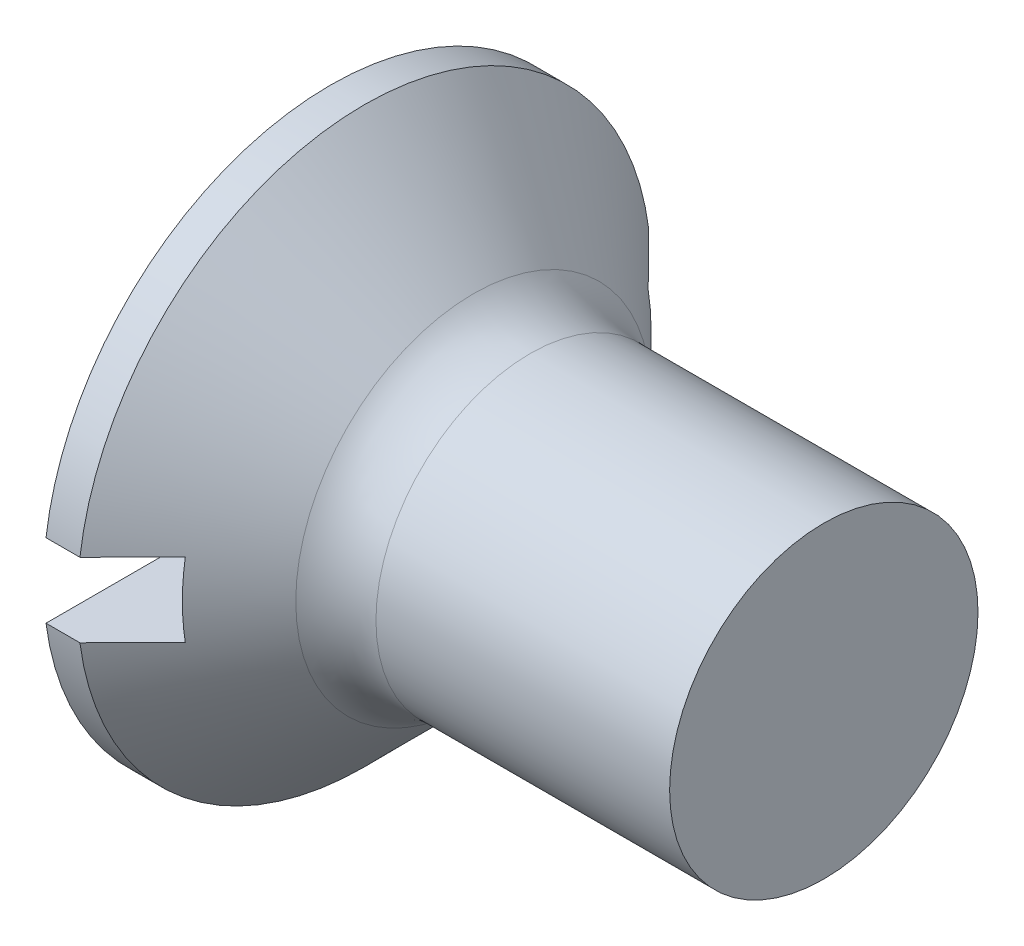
ISO-10303-21;
HEADER;
FILE_DESCRIPTION(('STEP AP214'),'2;1');
FILE_NAME('part.step','',(''),(''),'','','');
FILE_SCHEMA(('AUTOMOTIVE_DESIGN { 1 0 10303 214 1 1 1 1 }'));
ENDSEC;
DATA;
#1=APPLICATION_CONTEXT('core data for automotive mechanical design processes');
#2=APPLICATION_PROTOCOL_DEFINITION('international standard','automotive_design',2000,#1);
#3=PRODUCT_CONTEXT('',#1,'mechanical');
#4=PRODUCT('Part','Part','',(#3));
#5=PRODUCT_RELATED_PRODUCT_CATEGORY('part','',(#4));
#6=PRODUCT_DEFINITION_FORMATION('','',#4);
#7=PRODUCT_DEFINITION_CONTEXT('part definition',#1,'design');
#8=PRODUCT_DEFINITION('design','',#6,#7);
#9=PRODUCT_DEFINITION_SHAPE('','',#8);
#10=(LENGTH_UNIT() NAMED_UNIT(*) SI_UNIT(.MILLI.,.METRE.));
#11=(NAMED_UNIT(*) PLANE_ANGLE_UNIT() SI_UNIT($,.RADIAN.));
#12=(NAMED_UNIT(*) SI_UNIT($,.STERADIAN.) SOLID_ANGLE_UNIT());
#13=UNCERTAINTY_MEASURE_WITH_UNIT(LENGTH_MEASURE(1.E-05),#10,'distance_accuracy_value','');
#14=(GEOMETRIC_REPRESENTATION_CONTEXT(3) GLOBAL_UNCERTAINTY_ASSIGNED_CONTEXT((#13)) GLOBAL_UNIT_ASSIGNED_CONTEXT((#10,
#11,#12)) REPRESENTATION_CONTEXT('',''));
#15=CARTESIAN_POINT('',(0.,0.,0.));
#16=DIRECTION('',(0.,0.,1.));
#17=DIRECTION('',(1.,0.,0.));
#18=AXIS2_PLACEMENT_3D('',#15,#16,#17);
#19=CARTESIAN_POINT('',(0.,0.,0.));
#20=DIRECTION('',(-1.,0.,0.));
#21=DIRECTION('',(0.,0.,1.));
#22=AXIS2_PLACEMENT_3D('',#19,#20,#21);
#23=PLANE('',#22);
#24=DIRECTION('',(0.,0.,-1.));
#25=VECTOR('',#24,1.);
#26=CARTESIAN_POINT('',(0.,0.600000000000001,4.65));
#27=LINE('',#26,#25);
#28=CARTESIAN_POINT('',(0.,0.600000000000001,4.61112784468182));
#29=VERTEX_POINT('',#28);
#30=CARTESIAN_POINT('',(0.,0.599999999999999,-4.61112784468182));
#31=VERTEX_POINT('',#30);
#32=EDGE_CURVE('E169',#29,#31,#27,.T.);
#33=ORIENTED_EDGE('',*,*,#32,.F.);
#34=CARTESIAN_POINT('',(0.,0.,0.));
#35=DIRECTION('',(-1.,0.,0.));
#36=DIRECTION('',(0.,0.,1.));
#37=AXIS2_PLACEMENT_3D('',#34,#35,#36);
#38=CIRCLE('',#37,4.65);
#39=EDGE_CURVE('E113',#29,#31,#38,.T.);
#40=ORIENTED_EDGE('',*,*,#39,.T.);
#41=EDGE_LOOP('',(#33,#40));
#42=FACE_BOUND('',#41,.T.);
#43=ADVANCED_FACE('F32',(#42),#23,.T.);
#44=CARTESIAN_POINT('',(-6.34999999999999,0.,0.));
#45=DIRECTION('',(-1.,0.,0.));
#46=DIRECTION('',(0.,0.,1.));
#47=AXIS2_PLACEMENT_3D('',#44,#45,#46);
#48=CYLINDRICAL_SURFACE('',#47,4.65);
#49=DIRECTION('',(-1.,0.,0.));
#50=VECTOR('',#49,1.);
#51=CARTESIAN_POINT('',(-6.34999999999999,0.599999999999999,-4.61112784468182));
#52=LINE('',#51,#50);
#53=CARTESIAN_POINT('',(0.550000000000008,0.599999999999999,-4.61112784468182));
#54=VERTEX_POINT('',#53);
#55=EDGE_CURVE('E60',#31,#54,#52,.F.);
#56=ORIENTED_EDGE('',*,*,#55,.F.);
#57=ORIENTED_EDGE('',*,*,#39,.F.);
#58=DIRECTION('',(-1.,0.,0.));
#59=VECTOR('',#58,1.);
#60=CARTESIAN_POINT('',(-6.34999999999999,0.600000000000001,4.61112784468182));
#61=LINE('',#60,#59);
#62=CARTESIAN_POINT('',(0.550000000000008,0.600000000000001,4.61112784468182));
#63=VERTEX_POINT('',#62);
#64=EDGE_CURVE('E175',#63,#29,#61,.T.);
#65=ORIENTED_EDGE('',*,*,#64,.F.);
#66=CARTESIAN_POINT('',(0.550000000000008,0.,0.));
#67=DIRECTION('',(-1.,0.,0.));
#68=DIRECTION('',(0.,0.,1.));
#69=AXIS2_PLACEMENT_3D('',#66,#67,#68);
#70=CIRCLE('',#69,4.65);
#71=EDGE_CURVE('E107',#63,#54,#70,.T.);
#72=ORIENTED_EDGE('',*,*,#71,.T.);
#73=EDGE_LOOP('',(#56,#57,#65,#72));
#74=FACE_BOUND('',#73,.T.);
#75=ADVANCED_FACE('F153',(#74),#48,.T.);
#76=DIRECTION('',(0.,0.,1.));
#77=VECTOR('',#76,1.);
#78=CARTESIAN_POINT('',(0.,-0.600000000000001,-4.65));
#79=LINE('',#78,#77);
#80=CARTESIAN_POINT('',(0.,-0.600000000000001,-4.61112784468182));
#81=VERTEX_POINT('',#80);
#82=CARTESIAN_POINT('',(0.,-0.600000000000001,4.61112784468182));
#83=VERTEX_POINT('',#82);
#84=EDGE_CURVE('E101',#81,#83,#79,.T.);
#85=ORIENTED_EDGE('',*,*,#84,.F.);
#86=EDGE_CURVE('E109',#81,#83,#38,.T.);
#87=ORIENTED_EDGE('',*,*,#86,.T.);
#88=EDGE_LOOP('',(#85,#87));
#89=FACE_BOUND('',#88,.T.);
#90=ADVANCED_FACE('F155',(#89),#23,.T.);
#91=DIRECTION('',(-1.,0.,0.));
#92=VECTOR('',#91,1.);
#93=CARTESIAN_POINT('',(-6.34999999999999,-0.600000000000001,4.61112784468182));
#94=LINE('',#93,#92);
#95=CARTESIAN_POINT('',(0.550000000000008,-0.600000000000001,4.61112784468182));
#96=VERTEX_POINT('',#95);
#97=EDGE_CURVE('E174',#83,#96,#94,.F.);
#98=ORIENTED_EDGE('',*,*,#97,.F.);
#99=ORIENTED_EDGE('',*,*,#86,.F.);
#100=DIRECTION('',(-1.,0.,0.));
#101=VECTOR('',#100,1.);
#102=CARTESIAN_POINT('',(-6.34999999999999,-0.600000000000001,-4.61112784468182));
#103=LINE('',#102,#101);
#104=CARTESIAN_POINT('',(0.550000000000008,-0.600000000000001,-4.61112784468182));
#105=VERTEX_POINT('',#104);
#106=EDGE_CURVE('E172',#105,#81,#103,.T.);
#107=ORIENTED_EDGE('',*,*,#106,.F.);
#108=EDGE_CURVE('E110',#105,#96,#70,.T.);
#109=ORIENTED_EDGE('',*,*,#108,.T.);
#110=EDGE_LOOP('',(#98,#99,#107,#109));
#111=FACE_BOUND('',#110,.T.);
#112=ADVANCED_FACE('F150',(#111),#48,.T.);
#113=CARTESIAN_POINT('',(0.550000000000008,0.,0.));
#114=DIRECTION('',(-1.,0.,0.));
#115=DIRECTION('',(0.,0.,1.));
#116=AXIS2_PLACEMENT_3D('',#113,#114,#115);
#117=CONICAL_SURFACE('',#116,4.65,0.78539816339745);
#118=CARTESIAN_POINT('',(-5.05345798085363,0.599999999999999,-10.2358878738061));
#119=CARTESIAN_POINT('',(-4.7063338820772,0.599999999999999,-9.88816346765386));
#120=CARTESIAN_POINT('',(-4.35923588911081,0.599999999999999,-9.54041298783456));
#121=CARTESIAN_POINT('',(-3.66512028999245,0.599999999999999,-8.84482295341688));
#122=CARTESIAN_POINT('',(-3.31810268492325,0.599999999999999,-8.49698339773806));
#123=CARTESIAN_POINT('',(-2.6240861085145,0.599999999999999,-7.80108810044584));
#124=CARTESIAN_POINT('',(-2.27708717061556,0.599999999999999,-7.45303232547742));
#125=CARTESIAN_POINT('',(-1.58327190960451,0.599999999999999,-6.75674744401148));
#126=CARTESIAN_POINT('',(-1.23645558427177,0.599999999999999,-6.40851833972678));
#127=CARTESIAN_POINT('',(-0.530234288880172,0.599999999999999,-5.69884909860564));
#128=CARTESIAN_POINT('',(-0.170839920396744,0.599999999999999,-5.3373984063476));
#129=CARTESIAN_POINT('',(0.367846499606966,0.599999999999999,-4.79480605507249));
#130=CARTESIAN_POINT('',(0.547344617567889,0.599999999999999,-4.61386901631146));
#131=CARTESIAN_POINT('',(0.906142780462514,0.599999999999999,-4.251800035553));
#132=CARTESIAN_POINT('',(1.08544282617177,0.6,-4.07066809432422));
#133=CARTESIAN_POINT('',(1.44372217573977,0.6,-3.70815209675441));
#134=CARTESIAN_POINT('',(1.62270153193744,0.6,-3.52676809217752));
#135=CARTESIAN_POINT('',(1.98021132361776,0.6,-3.16355280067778));
#136=CARTESIAN_POINT('',(2.1587417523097,0.6,-2.98172150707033));
#137=CARTESIAN_POINT('',(2.51504600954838,0.6,-2.61734150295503));
#138=CARTESIAN_POINT('',(2.69281988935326,0.6,-2.43479284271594));
#139=CARTESIAN_POINT('',(2.95840184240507,0.6,-2.15993102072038));
#140=CARTESIAN_POINT('',(3.0467482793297,0.6,-2.06813839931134));
#141=CARTESIAN_POINT('',(3.22290791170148,0.6,-1.8840432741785));
#142=CARTESIAN_POINT('',(3.31072111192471,0.6,-1.79174077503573));
#143=CARTESIAN_POINT('',(3.44507973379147,0.6,-1.64924720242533));
#144=CARTESIAN_POINT('',(3.49191887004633,0.6,-1.59933324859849));
#145=CARTESIAN_POINT('',(3.58528403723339,0.6,-1.49921165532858));
#146=CARTESIAN_POINT('',(3.63181006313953,0.6,-1.44900401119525));
#147=CARTESIAN_POINT('',(3.72427703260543,0.6,-1.348388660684));
#148=CARTESIAN_POINT('',(3.77021949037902,0.6,-1.29798234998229));
#149=CARTESIAN_POINT('',(3.86152904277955,0.6,-1.19665513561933));
#150=CARTESIAN_POINT('',(3.90689615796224,0.6,-1.1457342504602));
#151=CARTESIAN_POINT('',(4.01209252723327,0.6,-1.02578570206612));
#152=CARTESIAN_POINT('',(4.07160553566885,0.6,-0.956477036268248));
#153=CARTESIAN_POINT('',(4.15917887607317,0.6,-0.850702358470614));
#154=CARTESIAN_POINT('',(4.18818199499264,0.6,-0.815019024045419));
#155=CARTESIAN_POINT('',(4.24528795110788,0.6,-0.742941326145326));
#156=CARTESIAN_POINT('',(4.27339088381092,0.6,-0.706547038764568));
#157=CARTESIAN_POINT('',(4.32869682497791,0.6,-0.632291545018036));
#158=CARTESIAN_POINT('',(4.35588213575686,0.6,-0.594417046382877));
#159=CARTESIAN_POINT('',(4.40832254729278,0.6,-0.517260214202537));
#160=CARTESIAN_POINT('',(4.43357498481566,0.6,-0.477976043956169));
#161=CARTESIAN_POINT('',(4.48075024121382,0.6,-0.397940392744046));
#162=CARTESIAN_POINT('',(4.50270366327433,0.6,-0.357207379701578));
#163=CARTESIAN_POINT('',(4.54164745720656,0.6,-0.273493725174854));
#164=CARTESIAN_POINT('',(4.55865364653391,0.6,-0.230520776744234));
#165=CARTESIAN_POINT('',(4.58372379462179,0.6,-0.145820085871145));
#166=CARTESIAN_POINT('',(4.59242377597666,0.6,-0.104295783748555));
#167=CARTESIAN_POINT('',(4.59893532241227,0.6,-0.0414391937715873));
#168=CARTESIAN_POINT('',(4.60002000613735,0.6,-0.0204304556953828));
#169=CARTESIAN_POINT('',(4.59997943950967,0.6,0.0215839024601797));
#170=CARTESIAN_POINT('',(4.59885411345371,0.6,0.0425895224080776));
#171=CARTESIAN_POINT('',(4.59227145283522,0.6,0.10501520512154));
#172=CARTESIAN_POINT('',(4.58363501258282,0.6,0.1461245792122));
#173=CARTESIAN_POINT('',(4.565808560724,0.6,0.206345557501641));
#174=CARTESIAN_POINT('',(4.55901965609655,0.6,0.226250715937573));
#175=CARTESIAN_POINT('',(4.54410905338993,0.6,0.265557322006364));
#176=CARTESIAN_POINT('',(4.53598757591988,0.6,0.284958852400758));
#177=CARTESIAN_POINT('',(4.51162458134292,0.6,0.33886087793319));
#178=CARTESIAN_POINT('',(4.49415337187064,0.6,0.372800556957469));
#179=CARTESIAN_POINT('',(4.45684225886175,0.6,0.439365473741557));
#180=CARTESIAN_POINT('',(4.436999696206,0.6,0.471989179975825));
#181=CARTESIAN_POINT('',(4.39563171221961,0.6,0.53629862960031));
#182=CARTESIAN_POINT('',(4.37410080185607,0.6,0.567980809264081));
#183=CARTESIAN_POINT('',(4.32989042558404,0.6,0.630537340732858));
#184=CARTESIAN_POINT('',(4.30721068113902,0.6,0.661411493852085));
#185=CARTESIAN_POINT('',(4.23751211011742,0.6,0.753681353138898));
#186=CARTESIAN_POINT('',(4.18923822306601,0.6,0.814124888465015));
#187=CARTESIAN_POINT('',(4.0909576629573,0.6,0.933321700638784));
#188=CARTESIAN_POINT('',(4.04095530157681,0.6,0.992078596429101));
#189=CARTESIAN_POINT('',(3.94086297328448,0.6,1.10735067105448));
#190=CARTESIAN_POINT('',(3.89079728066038,0.6,1.16388697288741));
#191=CARTESIAN_POINT('',(3.78992367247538,0.6,1.27629304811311));
#192=CARTESIAN_POINT('',(3.73911573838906,0.6,1.33216280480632));
#193=CARTESIAN_POINT('',(3.58591315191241,0.6,1.49908452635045));
#194=CARTESIAN_POINT('',(3.4827535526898,0.6,1.609433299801));
#195=CARTESIAN_POINT('',(3.27521830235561,0.6,1.82922471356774));
#196=CARTESIAN_POINT('',(3.17084134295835,0.6,1.93866611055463));
#197=CARTESIAN_POINT('',(2.96141984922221,0.6,2.15689179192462));
#198=CARTESIAN_POINT('',(2.85637536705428,0.6,2.26567612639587));
#199=CARTESIAN_POINT('',(2.64692360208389,0.6,2.481710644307));
#200=CARTESIAN_POINT('',(2.5425207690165,0.6,2.58896514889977));
#201=CARTESIAN_POINT('',(2.33341496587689,0.6,2.80318525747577));
#202=CARTESIAN_POINT('',(2.22871198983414,0.6,2.91015085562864));
#203=CARTESIAN_POINT('',(1.91438863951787,0.6,3.23063427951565));
#204=CARTESIAN_POINT('',(1.70445280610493,0.6,3.44384256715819));
#205=CARTESIAN_POINT('',(1.22510768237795,0.6,3.9295930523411));
#206=CARTESIAN_POINT('',(0.955548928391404,0.600000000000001,4.20198758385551));
#207=CARTESIAN_POINT('',(0.416004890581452,0.600000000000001,4.74635530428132));
#208=CARTESIAN_POINT('',(0.146019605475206,0.600000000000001,5.01832849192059));
#209=CARTESIAN_POINT('',(-0.664426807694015,0.600000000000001,5.83398149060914));
#210=CARTESIAN_POINT('',(-1.2052682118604,0.600000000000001,6.37728333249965));
#211=CARTESIAN_POINT('',(-2.297244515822,0.600000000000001,7.47334328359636));
#212=CARTESIAN_POINT('',(-2.84838746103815,0.600000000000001,8.02609337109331));
#213=CARTESIAN_POINT('',(-3.95082527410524,0.600000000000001,9.1312059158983));
#214=CARTESIAN_POINT('',(-4.5021200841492,0.600000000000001,9.683568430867));
#215=CARTESIAN_POINT('',(-5.05345798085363,0.600000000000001,10.2358878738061));
#216=B_SPLINE_CURVE_WITH_KNOTS('',3,(#118,#119,#120,#121,#122,#123,#124,#125,#126,#127,#128,
#129,#130,#131,#132,#133,#134,#135,#136,#137,#138,#139,#140,#141,#142,#143,#144,#145,#146,#147,
#148,#149,#150,#151,#152,#153,#154,#155,#156,#157,#158,#159,#160,#161,#162,#163,#164,#165,#166,
#167,#168,#169,#170,#171,#172,#173,#174,#175,#176,#177,#178,#179,#180,#181,#182,#183,#184,#185,
#186,#187,#188,#189,#190,#191,#192,#193,#194,#195,#196,#197,#198,#199,#200,#201,#202,#203,#204,
#205,#206,#207,#208,#209,#210,#211,#212,#213,#214,#215),.UNSPECIFIED.,.F.,.F.,(4,2,2,2,2,2,2,2,
2,2,2,2,2,2,2,2,2,2,2,2,2,2,2,2,2,2,2,2,2,2,2,2,2,2,2,2,2,2,2,2,2,2,2,2,2,2,2,2,4),(0.,
1.47399683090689,2.94801247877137,4.4224478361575,5.89686482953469,7.42601395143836,
8.19061836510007,8.95521977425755,9.71968231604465,10.4841563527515,11.2485777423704,
11.630779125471,12.0129770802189,12.2183239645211,12.4236741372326,12.6282760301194,
12.8328705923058,13.1068888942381,13.2448295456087,13.3827555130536,13.522578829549,
13.6625914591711,13.8012122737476,13.9393848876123,14.0658401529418,14.1288404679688,
14.1918429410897,14.3170190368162,14.3800826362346,14.4431358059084,14.557498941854,
14.6719915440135,14.7868731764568,14.9017827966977,15.1337679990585,15.365211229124,
15.5917537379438,15.8183019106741,16.2714608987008,16.7251625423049,17.1788291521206,
17.6278622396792,18.076904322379,18.9745538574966,20.1242253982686,21.2739004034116,
23.5737206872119,25.9154338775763,28.2566456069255),.UNSPECIFIED.);
#217=CARTESIAN_POINT('',(1.4,0.6,3.75233260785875));
#218=VERTEX_POINT('',#217);
#219=EDGE_CURVE('E11',#218,#63,#216,.T.);
#220=ORIENTED_EDGE('',*,*,#219,.F.);
#221=CARTESIAN_POINT('',(1.4,0.,0.));
#222=DIRECTION('',(1.,0.,0.));
#223=DIRECTION('',(0.,0.,-1.));
#224=AXIS2_PLACEMENT_3D('',#221,#222,#223);
#225=CIRCLE('',#224,3.80000000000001);
#226=CARTESIAN_POINT('',(1.4,-0.600000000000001,3.75233260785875));
#227=VERTEX_POINT('',#226);
#228=EDGE_CURVE('E89',#227,#218,#225,.F.);
#229=ORIENTED_EDGE('',*,*,#228,.F.);
#230=CARTESIAN_POINT('',(-5.05345798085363,-0.600000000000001,10.2358878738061));
#231=CARTESIAN_POINT('',(-4.7063338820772,-0.600000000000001,9.88816346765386));
#232=CARTESIAN_POINT('',(-4.35923588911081,-0.600000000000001,9.54041298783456));
#233=CARTESIAN_POINT('',(-3.66512028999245,-0.600000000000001,8.84482295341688));
#234=CARTESIAN_POINT('',(-3.31810268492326,-0.600000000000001,8.49698339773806));
#235=CARTESIAN_POINT('',(-2.6240861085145,-0.600000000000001,7.80108810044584));
#236=CARTESIAN_POINT('',(-2.27708717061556,-0.600000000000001,7.45303232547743));
#237=CARTESIAN_POINT('',(-1.58327190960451,-0.600000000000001,6.75674744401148));
#238=CARTESIAN_POINT('',(-1.23645558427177,-0.600000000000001,6.40851833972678));
#239=CARTESIAN_POINT('',(-0.530234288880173,-0.600000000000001,5.69884909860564));
#240=CARTESIAN_POINT('',(-0.170839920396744,-0.600000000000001,5.3373984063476));
#241=CARTESIAN_POINT('',(0.367846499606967,-0.600000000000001,4.79480605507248));
#242=CARTESIAN_POINT('',(0.547344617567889,-0.600000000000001,4.61386901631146));
#243=CARTESIAN_POINT('',(0.906142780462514,-0.600000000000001,4.251800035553));
#244=CARTESIAN_POINT('',(1.08544282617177,-0.600000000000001,4.07066809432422));
#245=CARTESIAN_POINT('',(1.44372217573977,-0.600000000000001,3.70815209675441));
#246=CARTESIAN_POINT('',(1.62270153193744,-0.600000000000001,3.52676809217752));
#247=CARTESIAN_POINT('',(1.98021132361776,-0.600000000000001,3.16355280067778));
#248=CARTESIAN_POINT('',(2.1587417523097,-0.600000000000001,2.98172150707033));
#249=CARTESIAN_POINT('',(2.51504600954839,-0.600000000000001,2.61734150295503));
#250=CARTESIAN_POINT('',(2.69281988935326,-0.600000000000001,2.43479284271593));
#251=CARTESIAN_POINT('',(2.95840184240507,-0.600000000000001,2.15993102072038));
#252=CARTESIAN_POINT('',(3.0467482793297,-0.600000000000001,2.06813839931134));
#253=CARTESIAN_POINT('',(3.22290791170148,-0.600000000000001,1.8840432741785));
#254=CARTESIAN_POINT('',(3.31072111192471,-0.600000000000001,1.79174077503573));
#255=CARTESIAN_POINT('',(3.44507973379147,-0.600000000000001,1.64924720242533));
#256=CARTESIAN_POINT('',(3.49191887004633,-0.600000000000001,1.59933324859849));
#257=CARTESIAN_POINT('',(3.58528403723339,-0.600000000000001,1.49921165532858));
#258=CARTESIAN_POINT('',(3.63181006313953,-0.600000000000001,1.44900401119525));
#259=CARTESIAN_POINT('',(3.72427703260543,-0.600000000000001,1.348388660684));
#260=CARTESIAN_POINT('',(3.77021949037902,-0.600000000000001,1.29798234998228));
#261=CARTESIAN_POINT('',(3.86152904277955,-0.600000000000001,1.19665513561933));
#262=CARTESIAN_POINT('',(3.90689615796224,-0.600000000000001,1.1457342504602));
#263=CARTESIAN_POINT('',(4.01209252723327,-0.600000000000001,1.02578570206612));
#264=CARTESIAN_POINT('',(4.07160553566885,-0.600000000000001,0.956477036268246));
#265=CARTESIAN_POINT('',(4.15917887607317,-0.600000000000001,0.850702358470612));
#266=CARTESIAN_POINT('',(4.18818199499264,-0.600000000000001,0.815019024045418));
#267=CARTESIAN_POINT('',(4.24528795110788,-0.600000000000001,0.742941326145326));
#268=CARTESIAN_POINT('',(4.27339088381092,-0.600000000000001,0.706547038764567));
#269=CARTESIAN_POINT('',(4.32869682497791,-0.600000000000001,0.632291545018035));
#270=CARTESIAN_POINT('',(4.35588213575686,-0.600000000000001,0.594417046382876));
#271=CARTESIAN_POINT('',(4.40832254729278,-0.600000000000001,0.517260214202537));
#272=CARTESIAN_POINT('',(4.43357498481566,-0.600000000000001,0.477976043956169));
#273=CARTESIAN_POINT('',(4.48075024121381,-0.600000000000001,0.397940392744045));
#274=CARTESIAN_POINT('',(4.50270366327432,-0.600000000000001,0.357207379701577));
#275=CARTESIAN_POINT('',(4.54164745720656,-0.600000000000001,0.273493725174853));
#276=CARTESIAN_POINT('',(4.55865364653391,-0.600000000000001,0.230520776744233));
#277=CARTESIAN_POINT('',(4.58372379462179,-0.600000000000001,0.145820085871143));
#278=CARTESIAN_POINT('',(4.59242377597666,-0.600000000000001,0.104295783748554));
#279=CARTESIAN_POINT('',(4.59893532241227,-0.600000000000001,0.0414391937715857));
#280=CARTESIAN_POINT('',(4.60002000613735,-0.600000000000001,0.0204304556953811));
#281=CARTESIAN_POINT('',(4.59997943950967,-0.600000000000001,-0.0215839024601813));
#282=CARTESIAN_POINT('',(4.59885411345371,-0.600000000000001,-0.0425895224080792));
#283=CARTESIAN_POINT('',(4.59227145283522,-0.600000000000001,-0.105015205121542));
#284=CARTESIAN_POINT('',(4.58363501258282,-0.600000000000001,-0.146124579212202));
#285=CARTESIAN_POINT('',(4.565808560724,-0.600000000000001,-0.206345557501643));
#286=CARTESIAN_POINT('',(4.55901965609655,-0.600000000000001,-0.226250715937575));
#287=CARTESIAN_POINT('',(4.54410905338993,-0.600000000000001,-0.265557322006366));
#288=CARTESIAN_POINT('',(4.53598757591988,-0.600000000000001,-0.284958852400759));
#289=CARTESIAN_POINT('',(4.51162458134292,-0.600000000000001,-0.338860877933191));
#290=CARTESIAN_POINT('',(4.49415337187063,-0.600000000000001,-0.37280055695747));
#291=CARTESIAN_POINT('',(4.45684225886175,-0.600000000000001,-0.439365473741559));
#292=CARTESIAN_POINT('',(4.43699969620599,-0.600000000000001,-0.471989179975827));
#293=CARTESIAN_POINT('',(4.3956317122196,-0.600000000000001,-0.536298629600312));
#294=CARTESIAN_POINT('',(4.37410080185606,-0.600000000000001,-0.567980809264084));
#295=CARTESIAN_POINT('',(4.32989042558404,-0.600000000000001,-0.630537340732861));
#296=CARTESIAN_POINT('',(4.30721068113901,-0.600000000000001,-0.661411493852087));
#297=CARTESIAN_POINT('',(4.23751211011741,-0.600000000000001,-0.753681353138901));
#298=CARTESIAN_POINT('',(4.18923822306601,-0.600000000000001,-0.814124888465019));
#299=CARTESIAN_POINT('',(4.09095766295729,-0.600000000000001,-0.933321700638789));
#300=CARTESIAN_POINT('',(4.04095530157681,-0.600000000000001,-0.992078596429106));
#301=CARTESIAN_POINT('',(3.94086297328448,-0.600000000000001,-1.10735067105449));
#302=CARTESIAN_POINT('',(3.89079728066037,-0.600000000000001,-1.16388697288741));
#303=CARTESIAN_POINT('',(3.78992367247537,-0.600000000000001,-1.27629304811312));
#304=CARTESIAN_POINT('',(3.73911573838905,-0.600000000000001,-1.33216280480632));
#305=CARTESIAN_POINT('',(3.5859131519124,-0.600000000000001,-1.49908452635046));
#306=CARTESIAN_POINT('',(3.48275355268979,-0.600000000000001,-1.60943329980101));
#307=CARTESIAN_POINT('',(3.2752183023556,-0.600000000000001,-1.82922471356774));
#308=CARTESIAN_POINT('',(3.17084134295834,-0.600000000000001,-1.93866611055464));
#309=CARTESIAN_POINT('',(2.9614198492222,-0.600000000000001,-2.15689179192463));
#310=CARTESIAN_POINT('',(2.85637536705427,-0.600000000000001,-2.26567612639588));
#311=CARTESIAN_POINT('',(2.64692360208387,-0.600000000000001,-2.48171064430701));
#312=CARTESIAN_POINT('',(2.54252076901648,-0.600000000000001,-2.58896514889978));
#313=CARTESIAN_POINT('',(2.33341496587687,-0.600000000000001,-2.80318525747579));
#314=CARTESIAN_POINT('',(2.22871198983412,-0.600000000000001,-2.91015085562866));
#315=CARTESIAN_POINT('',(1.91438863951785,-0.600000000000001,-3.23063427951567));
#316=CARTESIAN_POINT('',(1.70445280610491,-0.600000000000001,-3.44384256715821));
#317=CARTESIAN_POINT('',(1.22510768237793,-0.600000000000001,-3.92959305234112));
#318=CARTESIAN_POINT('',(0.955548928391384,-0.600000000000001,-4.20198758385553));
#319=CARTESIAN_POINT('',(0.416004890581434,-0.600000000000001,-4.74635530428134));
#320=CARTESIAN_POINT('',(0.146019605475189,-0.600000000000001,-5.01832849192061));
#321=CARTESIAN_POINT('',(-0.66442680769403,-0.600000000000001,-5.83398149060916));
#322=CARTESIAN_POINT('',(-1.20526821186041,-0.600000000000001,-6.37728333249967));
#323=CARTESIAN_POINT('',(-2.29724451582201,-0.600000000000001,-7.47334328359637));
#324=CARTESIAN_POINT('',(-2.84838746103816,-0.600000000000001,-8.02609337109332));
#325=CARTESIAN_POINT('',(-3.95082527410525,-0.600000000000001,-9.13120591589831));
#326=CARTESIAN_POINT('',(-4.5021200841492,-0.600000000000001,-9.68356843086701));
#327=CARTESIAN_POINT('',(-5.05345798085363,-0.600000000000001,-10.2358878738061));
#328=B_SPLINE_CURVE_WITH_KNOTS('',3,(#230,#231,#232,#233,#234,#235,#236,#237,#238,#239,#240,
#241,#242,#243,#244,#245,#246,#247,#248,#249,#250,#251,#252,#253,#254,#255,#256,#257,#258,#259,
#260,#261,#262,#263,#264,#265,#266,#267,#268,#269,#270,#271,#272,#273,#274,#275,#276,#277,#278,
#279,#280,#281,#282,#283,#284,#285,#286,#287,#288,#289,#290,#291,#292,#293,#294,#295,#296,#297,
#298,#299,#300,#301,#302,#303,#304,#305,#306,#307,#308,#309,#310,#311,#312,#313,#314,#315,#316,
#317,#318,#319,#320,#321,#322,#323,#324,#325,#326,#327),.UNSPECIFIED.,.F.,.F.,(4,2,2,2,2,2,2,2,
2,2,2,2,2,2,2,2,2,2,2,2,2,2,2,2,2,2,2,2,2,2,2,2,2,2,2,2,2,2,2,2,2,2,2,2,2,2,2,2,4),(0.,
1.47399683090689,2.94801247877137,4.4224478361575,5.89686482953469,7.42601395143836,
8.19061836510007,8.95521977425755,9.71968231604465,10.4841563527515,11.2485777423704,
11.630779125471,12.0129770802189,12.2183239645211,12.4236741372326,12.6282760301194,
12.8328705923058,13.1068888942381,13.2448295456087,13.3827555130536,13.522578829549,
13.6625914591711,13.8012122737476,13.9393848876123,14.0658401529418,14.1288404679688,
14.1918429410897,14.3170190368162,14.3800826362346,14.4431358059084,14.557498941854,
14.6719915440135,14.7868731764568,14.9017827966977,15.1337679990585,15.365211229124,
15.5917537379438,15.8183019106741,16.2714608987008,16.7251625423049,17.1788291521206,
17.6278622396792,18.076904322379,18.9745538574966,20.1242253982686,21.2739004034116,
23.5737206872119,25.9154338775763,28.2566456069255),.UNSPECIFIED.);
#329=EDGE_CURVE('E46',#96,#227,#328,.T.);
#330=ORIENTED_EDGE('',*,*,#329,.F.);
#331=ORIENTED_EDGE('',*,*,#108,.F.);
#332=CARTESIAN_POINT('',(1.4,-0.600000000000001,-3.75233260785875));
#333=VERTEX_POINT('',#332);
#334=EDGE_CURVE('E125',#333,#105,#328,.T.);
#335=ORIENTED_EDGE('',*,*,#334,.F.);
#336=CARTESIAN_POINT('',(1.4,0.6,-3.75233260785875));
#337=VERTEX_POINT('',#336);
#338=EDGE_CURVE('E97',#337,#333,#225,.F.);
#339=ORIENTED_EDGE('',*,*,#338,.F.);
#340=EDGE_CURVE('E36',#54,#337,#216,.T.);
#341=ORIENTED_EDGE('',*,*,#340,.F.);
#342=ORIENTED_EDGE('',*,*,#71,.F.);
#343=EDGE_LOOP('',(#220,#229,#330,#331,#335,#339,#341,#342));
#344=FACE_BOUND('',#343,.T.);
#345=CARTESIAN_POINT('',(2.31923881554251,0.,0.));
#346=DIRECTION('',(-1.,0.,0.));
#347=DIRECTION('',(0.,0.,1.));
#348=AXIS2_PLACEMENT_3D('',#345,#346,#347);
#349=CIRCLE('',#348,2.88076118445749);
#350=CARTESIAN_POINT('',(2.31923881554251,0.,2.88076118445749));
#351=VERTEX_POINT('',#350);
#352=EDGE_CURVE('E120',#351,#351,#349,.T.);
#353=ORIENTED_EDGE('',*,*,#352,.T.);
#354=EDGE_LOOP('',(#353));
#355=FACE_BOUND('',#354,.T.);
#356=ADVANCED_FACE('F104',(#344,#355),#117,.T.);
#357=CARTESIAN_POINT('',(-6.34999999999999,0.,0.));
#358=DIRECTION('',(-1.,0.,0.));
#359=DIRECTION('',(0.,0.,1.));
#360=AXIS2_PLACEMENT_3D('',#357,#358,#359);
#361=CYLINDRICAL_SURFACE('',#360,2.5);
#362=CARTESIAN_POINT('',(3.23847763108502,0.,0.));
#363=DIRECTION('',(-1.,0.,0.));
#364=DIRECTION('',(0.,0.,1.));
#365=AXIS2_PLACEMENT_3D('',#362,#363,#364);
#366=CIRCLE('',#365,2.5);
#367=CARTESIAN_POINT('',(3.23847763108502,0.,2.5));
#368=VERTEX_POINT('',#367);
#369=EDGE_CURVE('E123',#368,#368,#366,.F.);
#370=ORIENTED_EDGE('',*,*,#369,.T.);
#371=EDGE_LOOP('',(#370));
#372=FACE_BOUND('',#371,.T.);
#373=CARTESIAN_POINT('',(8.,0.,0.));
#374=DIRECTION('',(-1.,0.,0.));
#375=DIRECTION('',(0.,0.,1.));
#376=AXIS2_PLACEMENT_3D('',#373,#374,#375);
#377=CIRCLE('',#376,2.5);
#378=CARTESIAN_POINT('',(8.,0.,2.5));
#379=VERTEX_POINT('',#378);
#380=EDGE_CURVE('E116',#379,#379,#377,.T.);
#381=ORIENTED_EDGE('',*,*,#380,.T.);
#382=EDGE_LOOP('',(#381));
#383=FACE_BOUND('',#382,.T.);
#384=ADVANCED_FACE('F143',(#372,#383),#361,.T.);
#385=CARTESIAN_POINT('',(8.,2.5,0.));
#386=DIRECTION('',(1.,0.,0.));
#387=DIRECTION('',(0.,0.,-1.));
#388=AXIS2_PLACEMENT_3D('',#385,#386,#387);
#389=PLANE('',#388);
#390=ORIENTED_EDGE('',*,*,#380,.F.);
#391=EDGE_LOOP('',(#390));
#392=FACE_BOUND('',#391,.T.);
#393=ADVANCED_FACE('F141',(#392),#389,.T.);
#394=CARTESIAN_POINT('',(3.23847763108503,0.,0.));
#395=DIRECTION('',(-1.,0.,0.));
#396=DIRECTION('',(0.,0.,1.));
#397=AXIS2_PLACEMENT_3D('',#394,#395,#396);
#398=TOROIDAL_SURFACE('',#397,3.8,1.3);
#399=ORIENTED_EDGE('',*,*,#369,.F.);
#400=EDGE_LOOP('',(#399));
#401=FACE_BOUND('',#400,.T.);
#402=ORIENTED_EDGE('',*,*,#352,.F.);
#403=EDGE_LOOP('',(#402));
#404=FACE_BOUND('',#403,.T.);
#405=ADVANCED_FACE('F34',(#401,#404),#398,.F.);
#406=CARTESIAN_POINT('',(1.4,0.600000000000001,4.65));
#407=DIRECTION('',(0.,1.,0.));
#408=DIRECTION('',(0.,0.,1.));
#409=AXIS2_PLACEMENT_3D('',#406,#407,#408);
#410=PLANE('',#409);
#411=ORIENTED_EDGE('',*,*,#55,.T.);
#412=ORIENTED_EDGE('',*,*,#340,.T.);
#413=DIRECTION('',(0.,0.,-1.));
#414=VECTOR('',#413,1.);
#415=CARTESIAN_POINT('',(1.4,0.600000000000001,4.65));
#416=LINE('',#415,#414);
#417=EDGE_CURVE('E53',#218,#337,#416,.T.);
#418=ORIENTED_EDGE('',*,*,#417,.F.);
#419=ORIENTED_EDGE('',*,*,#219,.T.);
#420=ORIENTED_EDGE('',*,*,#64,.T.);
#421=ORIENTED_EDGE('',*,*,#32,.T.);
#422=EDGE_LOOP('',(#411,#412,#418,#419,#420,#421));
#423=FACE_BOUND('',#422,.T.);
#424=ADVANCED_FACE('F98',(#423),#410,.F.);
#425=CARTESIAN_POINT('',(1.4,-0.600000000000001,-4.65));
#426=DIRECTION('',(0.,-1.,0.));
#427=DIRECTION('',(0.,0.,-1.));
#428=AXIS2_PLACEMENT_3D('',#425,#426,#427);
#429=PLANE('',#428);
#430=ORIENTED_EDGE('',*,*,#97,.T.);
#431=ORIENTED_EDGE('',*,*,#329,.T.);
#432=DIRECTION('',(0.,0.,1.));
#433=VECTOR('',#432,1.);
#434=CARTESIAN_POINT('',(1.4,-0.600000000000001,-4.65));
#435=LINE('',#434,#433);
#436=EDGE_CURVE('E92',#333,#227,#435,.T.);
#437=ORIENTED_EDGE('',*,*,#436,.F.);
#438=ORIENTED_EDGE('',*,*,#334,.T.);
#439=ORIENTED_EDGE('',*,*,#106,.T.);
#440=ORIENTED_EDGE('',*,*,#84,.T.);
#441=EDGE_LOOP('',(#430,#431,#437,#438,#439,#440));
#442=FACE_BOUND('',#441,.T.);
#443=ADVANCED_FACE('F133',(#442),#429,.F.);
#444=CARTESIAN_POINT('',(1.4,-0.600000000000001,-4.65));
#445=DIRECTION('',(1.,0.,0.));
#446=DIRECTION('',(0.,0.,-1.));
#447=AXIS2_PLACEMENT_3D('',#444,#445,#446);
#448=PLANE('',#447);
#449=ORIENTED_EDGE('',*,*,#228,.T.);
#450=ORIENTED_EDGE('',*,*,#417,.T.);
#451=ORIENTED_EDGE('',*,*,#338,.T.);
#452=ORIENTED_EDGE('',*,*,#436,.T.);
#453=EDGE_LOOP('',(#449,#450,#451,#452));
#454=FACE_BOUND('',#453,.T.);
#455=ADVANCED_FACE('F90',(#454),#448,.F.);
#456=CLOSED_SHELL('',(#43,#75,#90,#112,#356,#384,#393,#405,#424,#443,#455));
#457=MANIFOLD_SOLID_BREP('B2',#456);
#458=ADVANCED_BREP_SHAPE_REPRESENTATION('',(#18,#457),#14);
#459=SHAPE_DEFINITION_REPRESENTATION(#9,#458);
ENDSEC;
END-ISO-10303-21;
